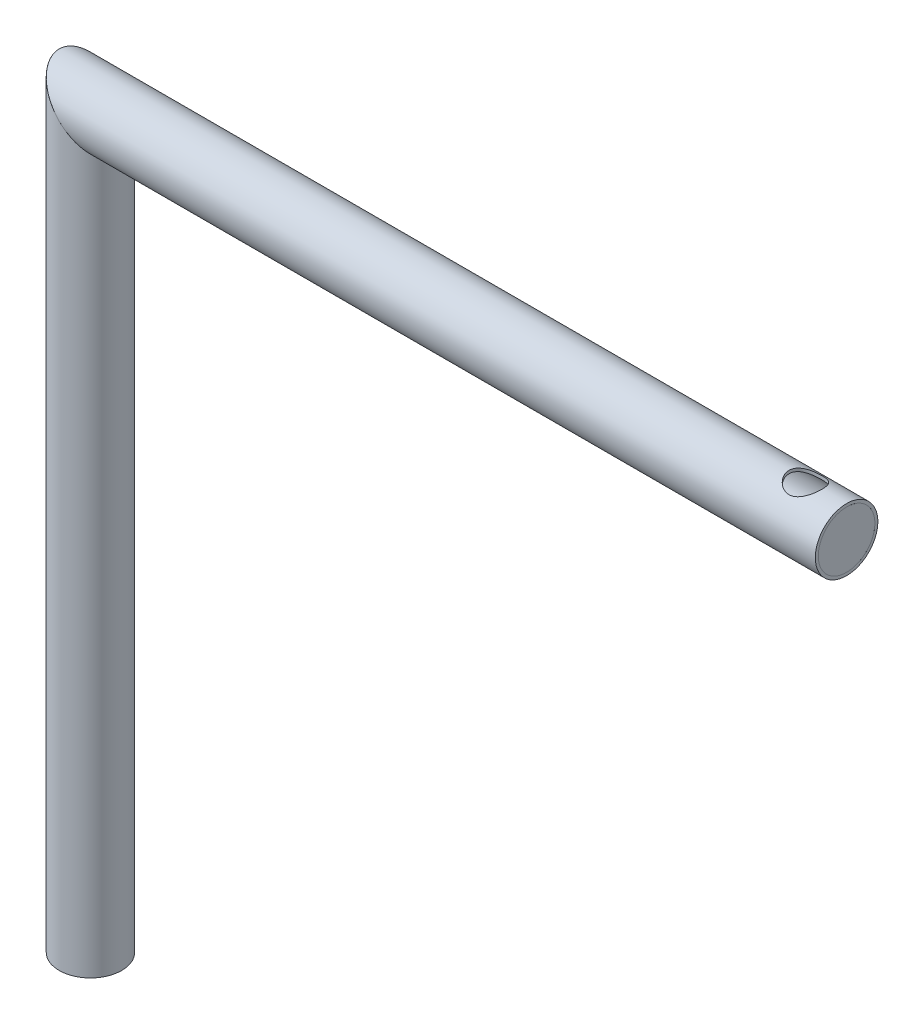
ISO-10303-21;
HEADER;
FILE_DESCRIPTION(('STEP AP214'),'2;1');
FILE_NAME('part.step','',(''),(''),'','','');
FILE_SCHEMA(('AUTOMOTIVE_DESIGN { 1 0 10303 214 1 1 1 1 }'));
ENDSEC;
DATA;
#1=APPLICATION_CONTEXT('core data for automotive mechanical design processes');
#2=APPLICATION_PROTOCOL_DEFINITION('international standard','automotive_design',2000,#1);
#3=PRODUCT_CONTEXT('',#1,'mechanical');
#4=PRODUCT('Part','Part','',(#3));
#5=PRODUCT_RELATED_PRODUCT_CATEGORY('part','',(#4));
#6=PRODUCT_DEFINITION_FORMATION('','',#4);
#7=PRODUCT_DEFINITION_CONTEXT('part definition',#1,'design');
#8=PRODUCT_DEFINITION('design','',#6,#7);
#9=PRODUCT_DEFINITION_SHAPE('','',#8);
#10=(LENGTH_UNIT() NAMED_UNIT(*) SI_UNIT(.MILLI.,.METRE.));
#11=(NAMED_UNIT(*) PLANE_ANGLE_UNIT() SI_UNIT($,.RADIAN.));
#12=(NAMED_UNIT(*) SI_UNIT($,.STERADIAN.) SOLID_ANGLE_UNIT());
#13=UNCERTAINTY_MEASURE_WITH_UNIT(LENGTH_MEASURE(1.E-05),#10,'distance_accuracy_value','');
#14=(GEOMETRIC_REPRESENTATION_CONTEXT(3) GLOBAL_UNCERTAINTY_ASSIGNED_CONTEXT((#13)) GLOBAL_UNIT_ASSIGNED_CONTEXT((#10,
#11,#12)) REPRESENTATION_CONTEXT('',''));
#15=CARTESIAN_POINT('',(0.,0.,0.));
#16=DIRECTION('',(0.,0.,1.));
#17=DIRECTION('',(1.,0.,0.));
#18=AXIS2_PLACEMENT_3D('',#15,#16,#17);
#19=CARTESIAN_POINT('',(0.,894.95,0.));
#20=DIRECTION('',(0.,-1.,0.));
#21=DIRECTION('',(0.,0.,-1.));
#22=AXIS2_PLACEMENT_3D('',#19,#20,#21);
#23=CYLINDRICAL_SURFACE('',#22,34.45);
#24=CARTESIAN_POINT('',(0.,0.,0.));
#25=DIRECTION('',(0.,-1.,0.));
#26=DIRECTION('',(0.,0.,-1.));
#27=AXIS2_PLACEMENT_3D('',#24,#25,#26);
#28=CIRCLE('',#27,34.45);
#29=CARTESIAN_POINT('',(0.,0.,-34.45));
#30=VERTEX_POINT('',#29);
#31=EDGE_CURVE('P0_E43',#30,#30,#28,.T.);
#32=ORIENTED_EDGE('',*,*,#31,.T.);
#33=EDGE_LOOP('',(#32));
#34=FACE_BOUND('',#33,.T.);
#35=CARTESIAN_POINT('',(0.,894.95,0.));
#36=DIRECTION('',(0.707106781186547,0.707106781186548,0.));
#37=DIRECTION('',(0.707106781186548,-0.707106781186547,0.));
#38=AXIS2_PLACEMENT_3D('',#35,#36,#37);
#39=ELLIPSE('',#38,48.7196572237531,34.45);
#40=CARTESIAN_POINT('',(34.45,860.5,0.));
#41=VERTEX_POINT('',#40);
#42=EDGE_CURVE('P0_E34',#41,#41,#39,.F.);
#43=ORIENTED_EDGE('',*,*,#42,.F.);
#44=EDGE_LOOP('',(#43));
#45=FACE_BOUND('',#44,.T.);
#46=ADVANCED_FACE('P0_F31',(#34,#45),#23,.F.);
#47=CARTESIAN_POINT('',(0.,894.95,0.));
#48=DIRECTION('',(0.707106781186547,0.707106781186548,0.));
#49=DIRECTION('',(-0.707106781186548,0.707106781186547,0.));
#50=AXIS2_PLACEMENT_3D('',#47,#48,#49);
#51=PLANE('',#50);
#52=CARTESIAN_POINT('',(0.,894.95,0.));
#53=DIRECTION('',(0.707106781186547,0.707106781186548,0.));
#54=DIRECTION('',(0.707106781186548,-0.707106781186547,0.));
#55=AXIS2_PLACEMENT_3D('',#52,#53,#54);
#56=ELLIPSE('',#55,53.8108260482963,38.05);
#57=CARTESIAN_POINT('',(38.05,856.9,0.));
#58=VERTEX_POINT('',#57);
#59=EDGE_CURVE('P0_E38',#58,#58,#56,.F.);
#60=ORIENTED_EDGE('',*,*,#59,.F.);
#61=EDGE_LOOP('',(#60));
#62=FACE_BOUND('',#61,.T.);
#63=ORIENTED_EDGE('',*,*,#42,.T.);
#64=EDGE_LOOP('',(#63));
#65=FACE_BOUND('',#64,.T.);
#66=ADVANCED_FACE('P0_F51',(#62,#65),#51,.T.);
#67=CARTESIAN_POINT('',(0.,0.,0.));
#68=DIRECTION('',(0.,1.,0.));
#69=DIRECTION('',(0.,0.,1.));
#70=AXIS2_PLACEMENT_3D('',#67,#68,#69);
#71=PLANE('',#70);
#72=CARTESIAN_POINT('',(0.,0.,0.));
#73=DIRECTION('',(0.,-1.,0.));
#74=DIRECTION('',(0.,0.,-1.));
#75=AXIS2_PLACEMENT_3D('',#72,#73,#74);
#76=CIRCLE('',#75,38.05);
#77=CARTESIAN_POINT('',(0.,0.,-38.05));
#78=VERTEX_POINT('',#77);
#79=EDGE_CURVE('P0_E10',#78,#78,#76,.F.);
#80=ORIENTED_EDGE('',*,*,#79,.F.);
#81=EDGE_LOOP('',(#80));
#82=FACE_BOUND('',#81,.T.);
#83=ORIENTED_EDGE('',*,*,#31,.F.);
#84=EDGE_LOOP('',(#83));
#85=FACE_BOUND('',#84,.T.);
#86=ADVANCED_FACE('P0_F57',(#82,#85),#71,.F.);
#87=CARTESIAN_POINT('',(0.,894.95,0.));
#88=DIRECTION('',(0.,-1.,0.));
#89=DIRECTION('',(0.,0.,-1.));
#90=AXIS2_PLACEMENT_3D('',#87,#88,#89);
#91=CYLINDRICAL_SURFACE('',#90,38.05);
#92=ORIENTED_EDGE('',*,*,#59,.T.);
#93=EDGE_LOOP('',(#92));
#94=FACE_BOUND('',#93,.T.);
#95=ORIENTED_EDGE('',*,*,#79,.T.);
#96=EDGE_LOOP('',(#95));
#97=FACE_BOUND('',#96,.T.);
#98=ADVANCED_FACE('P0_F59',(#94,#97),#91,.T.);
#99=CLOSED_SHELL('',(#46,#66,#86,#98));
#100=MANIFOLD_SOLID_BREP('P0_B2',#99);
#101=CARTESIAN_POINT('',(915.95,894.95,0.));
#102=DIRECTION('',(1.,0.,0.));
#103=DIRECTION('',(0.,1.,0.));
#104=AXIS2_PLACEMENT_3D('',#101,#102,#103);
#105=PLANE('',#104);
#106=CARTESIAN_POINT('',(915.95,894.95,0.));
#107=DIRECTION('',(1.,0.,0.));
#108=DIRECTION('',(0.,1.,0.));
#109=AXIS2_PLACEMENT_3D('',#106,#107,#108);
#110=CIRCLE('',#109,34.45);
#111=CARTESIAN_POINT('',(915.95,929.4,0.));
#112=VERTEX_POINT('',#111);
#113=EDGE_CURVE('P1_E18',#112,#112,#110,.T.);
#114=ORIENTED_EDGE('',*,*,#113,.F.);
#115=EDGE_LOOP('',(#114));
#116=FACE_BOUND('',#115,.T.);
#117=ADVANCED_FACE('P1_F15',(#116),#105,.F.);
#118=CARTESIAN_POINT('',(915.95,894.95,0.));
#119=DIRECTION('',(1.,0.,0.));
#120=DIRECTION('',(0.,1.,0.));
#121=AXIS2_PLACEMENT_3D('',#118,#119,#120);
#122=CYLINDRICAL_SURFACE('',#121,34.45);
#123=ORIENTED_EDGE('',*,*,#113,.T.);
#124=EDGE_LOOP('',(#123));
#125=FACE_BOUND('',#124,.T.);
#126=CARTESIAN_POINT('',(919.95,894.95,0.));
#127=DIRECTION('',(1.,0.,0.));
#128=DIRECTION('',(0.,1.,0.));
#129=AXIS2_PLACEMENT_3D('',#126,#127,#128);
#130=CIRCLE('',#129,34.45);
#131=CARTESIAN_POINT('',(919.95,929.4,0.));
#132=VERTEX_POINT('',#131);
#133=EDGE_CURVE('P1_E10',#132,#132,#130,.T.);
#134=ORIENTED_EDGE('',*,*,#133,.F.);
#135=EDGE_LOOP('',(#134));
#136=FACE_BOUND('',#135,.T.);
#137=ADVANCED_FACE('P1_F27',(#125,#136),#122,.T.);
#138=CARTESIAN_POINT('',(919.95,894.95,0.));
#139=DIRECTION('',(1.,0.,0.));
#140=DIRECTION('',(0.,1.,0.));
#141=AXIS2_PLACEMENT_3D('',#138,#139,#140);
#142=PLANE('',#141);
#143=ORIENTED_EDGE('',*,*,#133,.T.);
#144=EDGE_LOOP('',(#143));
#145=FACE_BOUND('',#144,.T.);
#146=ADVANCED_FACE('P1_F35',(#145),#142,.T.);
#147=CLOSED_SHELL('',(#117,#137,#146));
#148=MANIFOLD_SOLID_BREP('P1_B1',#147);
#149=CARTESIAN_POINT('',(919.95,894.95,0.));
#150=DIRECTION('',(-1.,0.,0.));
#151=DIRECTION('',(0.,0.,1.));
#152=AXIS2_PLACEMENT_3D('',#149,#150,#151);
#153=CYLINDRICAL_SURFACE('',#152,34.45);
#154=CARTESIAN_POINT('',(0.,894.95,0.));
#155=DIRECTION('',(-0.707106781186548,-0.707106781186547,0.));
#156=DIRECTION('',(-0.707106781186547,0.707106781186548,0.));
#157=AXIS2_PLACEMENT_3D('',#154,#155,#156);
#158=ELLIPSE('',#157,48.7196572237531,34.45);
#159=CARTESIAN_POINT('',(-34.45,929.4,0.));
#160=VERTEX_POINT('',#159);
#161=EDGE_CURVE('P2_E69',#160,#160,#158,.F.);
#162=ORIENTED_EDGE('',*,*,#161,.F.);
#163=EDGE_LOOP('',(#162));
#164=FACE_BOUND('',#163,.T.);
#165=CARTESIAN_POINT('',(919.95,894.95,0.));
#166=DIRECTION('',(-1.,0.,0.));
#167=DIRECTION('',(0.,0.,1.));
#168=AXIS2_PLACEMENT_3D('',#165,#166,#167);
#169=CIRCLE('',#168,34.45);
#170=CARTESIAN_POINT('',(919.95,894.95,34.45));
#171=VERTEX_POINT('',#170);
#172=EDGE_CURVE('P2_E67',#171,#171,#169,.T.);
#173=ORIENTED_EDGE('',*,*,#172,.F.);
#174=EDGE_LOOP('',(#173));
#175=FACE_BOUND('',#174,.T.);
#176=CARTESIAN_POINT('',(869.95,866.9,20.));
#177=CARTESIAN_POINT('',(869.443007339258,866.899996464,19.9999975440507));
#178=CARTESIAN_POINT('',(868.935978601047,866.886201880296,19.9806910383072));
#179=CARTESIAN_POINT('',(867.926288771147,866.83161393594,19.9037944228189));
#180=CARTESIAN_POINT('',(867.423628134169,866.790817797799,19.8462003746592));
#181=CARTESIAN_POINT('',(866.426268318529,866.683888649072,19.6936054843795));
#182=CARTESIAN_POINT('',(865.931577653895,866.617730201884,19.5985670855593));
#183=CARTESIAN_POINT('',(864.954184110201,866.462673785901,19.3724928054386));
#184=CARTESIAN_POINT('',(864.471481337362,866.373775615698,19.2414566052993));
#185=CARTESIAN_POINT('',(863.524286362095,866.177111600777,18.9460971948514));
#186=CARTESIAN_POINT('',(863.05968917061,866.06948424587,18.7820170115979));
#187=CARTESIAN_POINT('',(862.14708035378,865.838266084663,18.4215981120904));
#188=CARTESIAN_POINT('',(861.699076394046,865.714668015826,18.2252447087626));
#189=CARTESIAN_POINT('',(860.821513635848,865.45498300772,17.8019132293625));
#190=CARTESIAN_POINT('',(860.391957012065,865.318894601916,17.5749315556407));
#191=CARTESIAN_POINT('',(859.552839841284,865.037674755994,17.0919094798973));
#192=CARTESIAN_POINT('',(859.143273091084,864.892546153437,16.8358781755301));
#193=CARTESIAN_POINT('',(858.299658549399,864.579578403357,16.2652259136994));
#194=CARTESIAN_POINT('',(857.868136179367,864.411035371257,15.9472531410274));
#195=CARTESIAN_POINT('',(857.032663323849,864.070970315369,15.2783769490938));
#196=CARTESIAN_POINT('',(856.628714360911,863.899448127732,14.9274717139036));
#197=CARTESIAN_POINT('',(855.849717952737,863.557358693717,14.1939572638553));
#198=CARTESIAN_POINT('',(855.474689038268,863.386792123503,13.8113280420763));
#199=CARTESIAN_POINT('',(854.755547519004,863.05058216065,13.0159926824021));
#200=CARTESIAN_POINT('',(854.411436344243,862.884938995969,12.6032851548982));
#201=CARTESIAN_POINT('',(853.723576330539,862.546280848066,11.7069681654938));
#202=CARTESIAN_POINT('',(853.383244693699,862.374162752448,11.2203857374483));
#203=CARTESIAN_POINT('',(852.745173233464,862.045078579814,10.2151045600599));
#204=CARTESIAN_POINT('',(852.447436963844,861.888113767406,9.69640313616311));
#205=CARTESIAN_POINT('',(851.897905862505,861.593939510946,8.63025377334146));
#206=CARTESIAN_POINT('',(851.646081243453,861.456717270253,8.08282477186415));
#207=CARTESIAN_POINT('',(851.191396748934,861.206086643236,6.96275472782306));
#208=CARTESIAN_POINT('',(850.988529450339,861.092674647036,6.39011752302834));
#209=CARTESIAN_POINT('',(850.650829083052,860.902343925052,5.2772023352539));
#210=CARTESIAN_POINT('',(850.511496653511,860.823049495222,4.73869454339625));
#211=CARTESIAN_POINT('',(850.277795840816,860.6893972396,3.64894865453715));
#212=CARTESIAN_POINT('',(850.183424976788,860.635038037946,3.09771126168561));
#213=CARTESIAN_POINT('',(850.041160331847,860.552892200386,1.98770604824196));
#214=CARTESIAN_POINT('',(849.993233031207,860.525086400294,1.42894395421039));
#215=CARTESIAN_POINT('',(849.944527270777,860.496828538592,0.308697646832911));
#216=CARTESIAN_POINT('',(849.943744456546,860.496373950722,-0.252786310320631));
#217=CARTESIAN_POINT('',(849.986659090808,860.521272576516,-1.30785225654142));
#218=CARTESIAN_POINT('',(850.025186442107,860.543626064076,-1.80172596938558));
#219=CARTESIAN_POINT('',(850.138527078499,860.609137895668,-2.78385325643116));
#220=CARTESIAN_POINT('',(850.213336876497,860.652294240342,-3.27210736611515));
#221=CARTESIAN_POINT('',(850.398328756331,860.758413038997,-4.23966890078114));
#222=CARTESIAN_POINT('',(850.508512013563,860.82137615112,-4.71897602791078));
#223=CARTESIAN_POINT('',(850.762994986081,860.965699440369,-5.66560525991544));
#224=CARTESIAN_POINT('',(850.907296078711,861.047060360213,-6.13292688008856));
#225=CARTESIAN_POINT('',(851.229780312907,861.227142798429,-7.05652403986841));
#226=CARTESIAN_POINT('',(851.408221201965,861.325995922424,-7.512683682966));
#227=CARTESIAN_POINT('',(851.796563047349,861.538574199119,-8.40777928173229));
#228=CARTESIAN_POINT('',(852.006463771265,861.652299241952,-8.84671536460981));
#229=CARTESIAN_POINT('',(852.456055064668,861.892406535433,-9.70550630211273));
#230=CARTESIAN_POINT('',(852.695750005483,862.018790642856,-10.1253583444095));
#231=CARTESIAN_POINT('',(853.203259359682,862.281839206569,-10.9443506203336));
#232=CARTESIAN_POINT('',(853.471076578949,862.418504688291,-11.3434887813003));
#233=CARTESIAN_POINT('',(854.06564439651,862.71583282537,-12.1644080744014));
#234=CARTESIAN_POINT('',(854.395630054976,862.877446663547,-12.5835044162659));
#235=CARTESIAN_POINT('',(855.086648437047,863.206820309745,-13.392681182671));
#236=CARTESIAN_POINT('',(855.447683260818,863.374580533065,-13.7827596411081));
#237=CARTESIAN_POINT('',(856.199491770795,863.712744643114,-14.5329229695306));
#238=CARTESIAN_POINT('',(856.590301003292,863.8831514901,-14.8929708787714));
#239=CARTESIAN_POINT('',(857.399688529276,864.222523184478,-15.5811387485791));
#240=CARTESIAN_POINT('',(857.818267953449,864.391487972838,-15.9092574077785));
#241=CARTESIAN_POINT('',(858.727071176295,864.741346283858,-16.5647773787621));
#242=CARTESIAN_POINT('',(859.220203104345,864.921629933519,-16.8884871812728));
#243=CARTESIAN_POINT('',(860.236572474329,865.26961505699,-17.4928242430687));
#244=CARTESIAN_POINT('',(860.75981460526,865.437314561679,-17.7734447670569));
#245=CARTESIAN_POINT('',(861.833015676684,865.753673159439,-18.28847250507));
#246=CARTESIAN_POINT('',(862.382929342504,865.90236306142,-18.5229548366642));
#247=CARTESIAN_POINT('',(863.50695886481,866.174689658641,-18.9432535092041));
#248=CARTESIAN_POINT('',(864.081064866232,866.298336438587,-19.1290894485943));
#249=CARTESIAN_POINT('',(865.09078122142,866.485297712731,-19.4057459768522));
#250=CARTESIAN_POINT('',(865.521767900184,866.555881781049,-19.5086679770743));
#251=CARTESIAN_POINT('',(866.392136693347,866.678540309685,-19.6860036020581));
#252=CARTESIAN_POINT('',(866.831517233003,866.730618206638,-19.7604225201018));
#253=CARTESIAN_POINT('',(867.715875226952,866.814609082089,-19.8798296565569));
#254=CARTESIAN_POINT('',(868.160848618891,866.846535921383,-19.9248381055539));
#255=CARTESIAN_POINT('',(869.053871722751,866.889234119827,-19.9849260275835));
#256=CARTESIAN_POINT('',(869.501921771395,866.900003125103,-20.0000021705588));
#257=CARTESIAN_POINT('',(870.456992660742,866.899996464,-19.9999975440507));
#258=CARTESIAN_POINT('',(870.964021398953,866.886201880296,-19.9806910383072));
#259=CARTESIAN_POINT('',(871.973711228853,866.83161393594,-19.9037944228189));
#260=CARTESIAN_POINT('',(872.476371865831,866.790817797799,-19.8462003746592));
#261=CARTESIAN_POINT('',(873.473731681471,866.683888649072,-19.6936054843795));
#262=CARTESIAN_POINT('',(873.968422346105,866.617730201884,-19.5985670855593));
#263=CARTESIAN_POINT('',(874.945815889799,866.462673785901,-19.3724928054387));
#264=CARTESIAN_POINT('',(875.428518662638,866.373775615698,-19.2414566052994));
#265=CARTESIAN_POINT('',(876.375713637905,866.177111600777,-18.9460971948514));
#266=CARTESIAN_POINT('',(876.84031082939,866.06948424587,-18.7820170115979));
#267=CARTESIAN_POINT('',(877.75291964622,865.838266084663,-18.4215981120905));
#268=CARTESIAN_POINT('',(878.200923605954,865.714668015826,-18.2252447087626));
#269=CARTESIAN_POINT('',(879.078486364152,865.45498300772,-17.8019132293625));
#270=CARTESIAN_POINT('',(879.508042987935,865.318894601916,-17.5749315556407));
#271=CARTESIAN_POINT('',(880.347160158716,865.037674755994,-17.0919094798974));
#272=CARTESIAN_POINT('',(880.756726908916,864.892546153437,-16.8358781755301));
#273=CARTESIAN_POINT('',(881.600341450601,864.579578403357,-16.2652259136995));
#274=CARTESIAN_POINT('',(882.031863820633,864.411035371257,-15.9472531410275));
#275=CARTESIAN_POINT('',(882.867336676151,864.070970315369,-15.2783769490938));
#276=CARTESIAN_POINT('',(883.271285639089,863.899448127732,-14.9274717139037));
#277=CARTESIAN_POINT('',(884.050282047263,863.557358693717,-14.1939572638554));
#278=CARTESIAN_POINT('',(884.425310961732,863.386792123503,-13.8113280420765));
#279=CARTESIAN_POINT('',(885.144452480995,863.05058216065,-13.0159926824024));
#280=CARTESIAN_POINT('',(885.488563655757,862.884938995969,-12.6032851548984));
#281=CARTESIAN_POINT('',(886.176423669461,862.546280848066,-11.706968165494));
#282=CARTESIAN_POINT('',(886.516755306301,862.374162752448,-11.2203857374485));
#283=CARTESIAN_POINT('',(887.154826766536,862.045078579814,-10.2151045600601));
#284=CARTESIAN_POINT('',(887.452563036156,861.888113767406,-9.69640313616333));
#285=CARTESIAN_POINT('',(888.002094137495,861.593939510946,-8.63025377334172));
#286=CARTESIAN_POINT('',(888.253918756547,861.456717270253,-8.08282477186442));
#287=CARTESIAN_POINT('',(888.708603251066,861.206086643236,-6.96275472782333));
#288=CARTESIAN_POINT('',(888.911470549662,861.092674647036,-6.3901175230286));
#289=CARTESIAN_POINT('',(889.249170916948,860.902343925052,-5.27720233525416));
#290=CARTESIAN_POINT('',(889.388503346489,860.823049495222,-4.73869454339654));
#291=CARTESIAN_POINT('',(889.622204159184,860.6893972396,-3.64894865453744));
#292=CARTESIAN_POINT('',(889.716575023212,860.635038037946,-3.09771126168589));
#293=CARTESIAN_POINT('',(889.858839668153,860.552892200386,-1.98770604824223));
#294=CARTESIAN_POINT('',(889.906766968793,860.525086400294,-1.42894395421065));
#295=CARTESIAN_POINT('',(889.955472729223,860.496828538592,-0.308697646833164));
#296=CARTESIAN_POINT('',(889.956255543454,860.496373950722,0.252786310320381));
#297=CARTESIAN_POINT('',(889.913340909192,860.521272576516,1.30785225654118));
#298=CARTESIAN_POINT('',(889.874813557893,860.543626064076,1.80172596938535));
#299=CARTESIAN_POINT('',(889.761472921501,860.609137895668,2.78385325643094));
#300=CARTESIAN_POINT('',(889.686663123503,860.652294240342,3.27210736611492));
#301=CARTESIAN_POINT('',(889.50167124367,860.758413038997,4.23966890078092));
#302=CARTESIAN_POINT('',(889.391487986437,860.82137615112,4.71897602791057));
#303=CARTESIAN_POINT('',(889.137005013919,860.965699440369,5.66560525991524));
#304=CARTESIAN_POINT('',(888.992703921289,861.047060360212,6.13292688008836));
#305=CARTESIAN_POINT('',(888.670219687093,861.227142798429,7.05652403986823));
#306=CARTESIAN_POINT('',(888.491778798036,861.325995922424,7.51268368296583));
#307=CARTESIAN_POINT('',(888.103436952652,861.538574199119,8.40777928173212));
#308=CARTESIAN_POINT('',(887.893536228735,861.652299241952,8.84671536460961));
#309=CARTESIAN_POINT('',(887.443944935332,861.892406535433,9.70550630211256));
#310=CARTESIAN_POINT('',(887.204249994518,862.018790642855,10.1253583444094));
#311=CARTESIAN_POINT('',(886.696740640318,862.281839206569,10.9443506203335));
#312=CARTESIAN_POINT('',(886.428923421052,862.418504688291,11.3434887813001));
#313=CARTESIAN_POINT('',(885.834355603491,862.71583282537,12.1644080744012));
#314=CARTESIAN_POINT('',(885.504369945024,862.877446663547,12.5835044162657));
#315=CARTESIAN_POINT('',(884.813351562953,863.206820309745,13.3926811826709));
#316=CARTESIAN_POINT('',(884.452316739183,863.374580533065,13.7827596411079));
#317=CARTESIAN_POINT('',(883.700508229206,863.712744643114,14.5329229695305));
#318=CARTESIAN_POINT('',(883.309698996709,863.8831514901,14.8929708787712));
#319=CARTESIAN_POINT('',(882.500311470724,864.222523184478,15.5811387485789));
#320=CARTESIAN_POINT('',(882.081732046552,864.391487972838,15.9092574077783));
#321=CARTESIAN_POINT('',(881.172928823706,864.741346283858,16.5647773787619));
#322=CARTESIAN_POINT('',(880.679796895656,864.921629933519,16.8884871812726));
#323=CARTESIAN_POINT('',(879.663427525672,865.26961505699,17.4928242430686));
#324=CARTESIAN_POINT('',(879.14018539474,865.437314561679,17.7734447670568));
#325=CARTESIAN_POINT('',(878.066984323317,865.753673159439,18.2884725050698));
#326=CARTESIAN_POINT('',(877.517070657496,865.90236306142,18.5229548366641));
#327=CARTESIAN_POINT('',(876.393041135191,866.174689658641,18.943253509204));
#328=CARTESIAN_POINT('',(875.818935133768,866.298336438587,19.1290894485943));
#329=CARTESIAN_POINT('',(874.80921877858,866.485297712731,19.4057459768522));
#330=CARTESIAN_POINT('',(874.378232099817,866.555881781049,19.5086679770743));
#331=CARTESIAN_POINT('',(873.507863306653,866.678540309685,19.6860036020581));
#332=CARTESIAN_POINT('',(873.068482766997,866.730618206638,19.7604225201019));
#333=CARTESIAN_POINT('',(872.184124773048,866.814609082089,19.879829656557));
#334=CARTESIAN_POINT('',(871.739151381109,866.846535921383,19.9248381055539));
#335=CARTESIAN_POINT('',(870.846128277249,866.889234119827,19.9849260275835));
#336=CARTESIAN_POINT('',(870.398078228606,866.900003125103,20.0000021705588));
#337=CARTESIAN_POINT('',(869.95,866.9,20.));
#338=B_SPLINE_CURVE_WITH_KNOTS('',3,(#176,#177,#178,#179,#180,#181,#182,#183,#184,#185,#186,
#187,#188,#189,#190,#191,#192,#193,#194,#195,#196,#197,#198,#199,#200,#201,#202,#203,#204,#205,
#206,#207,#208,#209,#210,#211,#212,#213,#214,#215,#216,#217,#218,#219,#220,#221,#222,#223,#224,
#225,#226,#227,#228,#229,#230,#231,#232,#233,#234,#235,#236,#237,#238,#239,#240,#241,#242,#243,
#244,#245,#246,#247,#248,#249,#250,#251,#252,#253,#254,#255,#256,#257,#258,#259,#260,#261,#262,
#263,#264,#265,#266,#267,#268,#269,#270,#271,#272,#273,#274,#275,#276,#277,#278,#279,#280,#281,
#282,#283,#284,#285,#286,#287,#288,#289,#290,#291,#292,#293,#294,#295,#296,#297,#298,#299,#300,
#301,#302,#303,#304,#305,#306,#307,#308,#309,#310,#311,#312,#313,#314,#315,#316,#317,#318,#319,
#320,#321,#322,#323,#324,#325,#326,#327,#328,#329,#330,#331,#332,#333,#334,#335,#336,#337),
.UNSPECIFIED.,.T.,.F.,(4,2,2,2,2,2,2,2,2,2,2,2,2,2,2,2,2,2,2,2,2,2,2,2,2,2,2,2,2,2,2,2,2,2,2,2,
2,2,2,2,2,2,2,2,2,2,2,2,2,2,2,2,2,2,2,2,2,2,2,2,2,2,2,2,2,2,2,2,2,2,2,2,2,2,2,2,2,2,2,2,4),(0.,
1.52049337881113,3.04114318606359,4.56332210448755,6.08551450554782,7.59689571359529,
9.10896664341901,10.6212153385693,12.1329917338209,13.8169686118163,15.5010384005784,
17.1861784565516,18.8713964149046,20.7236647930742,22.5760876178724,24.4273042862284,
26.278240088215,27.9614415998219,29.6445502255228,31.3264431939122,33.0081808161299,
34.4940426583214,35.9797617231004,37.4655301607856,38.9513585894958,40.4488820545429,
41.946394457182,43.4441268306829,44.9420087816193,46.6123663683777,48.2828370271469,
49.9553342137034,51.6278995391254,53.4760524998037,55.3244940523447,57.1699007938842,
59.0145629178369,60.3593955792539,61.7039783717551,63.0476352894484,64.3914416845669,
65.9119350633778,67.4325848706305,68.9547637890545,70.4769561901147,71.9883373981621,
73.500408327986,75.0126570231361,76.5244334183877,78.2084102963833,79.8924800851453,
81.5776201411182,83.2628380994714,85.1151064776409,86.9675293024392,88.8187459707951,
90.6696817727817,92.3528832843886,94.0359919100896,95.717884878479,97.3996225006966,
98.8854843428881,100.371203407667,101.856971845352,103.342800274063,104.84032373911,
106.337836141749,107.83556851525,109.333450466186,111.003808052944,112.674278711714,
114.34677589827,116.019341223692,117.86749418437,119.715935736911,121.561342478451,
123.406004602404,124.750837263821,126.095420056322,127.439076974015,128.782883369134),.UNSPECIFIED.);
#339=CARTESIAN_POINT('',(869.95,866.9,20.));
#340=VERTEX_POINT('',#339);
#341=EDGE_CURVE('P2_E19',#340,#340,#338,.T.);
#342=ORIENTED_EDGE('',*,*,#341,.T.);
#343=EDGE_LOOP('',(#342));
#344=FACE_BOUND('',#343,.T.);
#345=CARTESIAN_POINT('',(869.95,923.,20.));
#346=CARTESIAN_POINT('',(870.456992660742,923.000003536,19.9999975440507));
#347=CARTESIAN_POINT('',(870.964021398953,923.013798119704,19.9806910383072));
#348=CARTESIAN_POINT('',(871.973711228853,923.068386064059,19.9037944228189));
#349=CARTESIAN_POINT('',(872.476371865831,923.109182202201,19.8462003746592));
#350=CARTESIAN_POINT('',(873.473731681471,923.216111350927,19.6936054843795));
#351=CARTESIAN_POINT('',(873.968422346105,923.282269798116,19.5985670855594));
#352=CARTESIAN_POINT('',(874.945815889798,923.437326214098,19.3724928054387));
#353=CARTESIAN_POINT('',(875.428518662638,923.526224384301,19.2414566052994));
#354=CARTESIAN_POINT('',(876.375713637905,923.722888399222,18.9460971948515));
#355=CARTESIAN_POINT('',(876.84031082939,923.830515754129,18.782017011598));
#356=CARTESIAN_POINT('',(877.75291964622,924.061733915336,18.4215981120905));
#357=CARTESIAN_POINT('',(878.200923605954,924.185331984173,18.2252447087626));
#358=CARTESIAN_POINT('',(879.078486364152,924.445016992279,17.8019132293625));
#359=CARTESIAN_POINT('',(879.508042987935,924.581105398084,17.5749315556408));
#360=CARTESIAN_POINT('',(880.347160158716,924.862325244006,17.0919094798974));
#361=CARTESIAN_POINT('',(880.756726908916,925.007453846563,16.8358781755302));
#362=CARTESIAN_POINT('',(881.600341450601,925.320421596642,16.2652259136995));
#363=CARTESIAN_POINT('',(882.031863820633,925.488964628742,15.9472531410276));
#364=CARTESIAN_POINT('',(882.867336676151,925.82902968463,15.278376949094));
#365=CARTESIAN_POINT('',(883.271285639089,926.000551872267,14.9274717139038));
#366=CARTESIAN_POINT('',(884.050282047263,926.342641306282,14.1939572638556));
#367=CARTESIAN_POINT('',(884.425310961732,926.513207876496,13.8113280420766));
#368=CARTESIAN_POINT('',(885.144452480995,926.84941783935,13.0159926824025));
#369=CARTESIAN_POINT('',(885.488563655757,927.015061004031,12.6032851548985));
#370=CARTESIAN_POINT('',(886.176423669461,927.353719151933,11.706968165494));
#371=CARTESIAN_POINT('',(886.516755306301,927.525837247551,11.2203857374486));
#372=CARTESIAN_POINT('',(887.154826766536,927.854921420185,10.2151045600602));
#373=CARTESIAN_POINT('',(887.452563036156,928.011886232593,9.69640313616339));
#374=CARTESIAN_POINT('',(888.002094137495,928.306060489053,8.63025377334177));
#375=CARTESIAN_POINT('',(888.253918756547,928.443282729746,8.08282477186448));
#376=CARTESIAN_POINT('',(888.708603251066,928.693913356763,6.96275472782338));
#377=CARTESIAN_POINT('',(888.911470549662,928.807325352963,6.39011752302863));
#378=CARTESIAN_POINT('',(889.249170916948,928.997656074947,5.27720233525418));
#379=CARTESIAN_POINT('',(889.388503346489,929.076950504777,4.73869454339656));
#380=CARTESIAN_POINT('',(889.622204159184,929.210602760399,3.64894865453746));
#381=CARTESIAN_POINT('',(889.716575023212,929.264961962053,3.09771126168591));
#382=CARTESIAN_POINT('',(889.858839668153,929.347107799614,1.98770604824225));
#383=CARTESIAN_POINT('',(889.906766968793,929.374913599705,1.42894395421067));
#384=CARTESIAN_POINT('',(889.955472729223,929.403171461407,0.308697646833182));
#385=CARTESIAN_POINT('',(889.956255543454,929.403626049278,-0.252786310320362));
#386=CARTESIAN_POINT('',(889.913340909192,929.378727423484,-1.30785225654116));
#387=CARTESIAN_POINT('',(889.874813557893,929.356373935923,-1.80172596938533));
#388=CARTESIAN_POINT('',(889.761472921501,929.290862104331,-2.78385325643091));
#389=CARTESIAN_POINT('',(889.686663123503,929.247705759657,-3.27210736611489));
#390=CARTESIAN_POINT('',(889.50167124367,929.141586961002,-4.23966890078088));
#391=CARTESIAN_POINT('',(889.391487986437,929.078623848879,-4.71897602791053));
#392=CARTESIAN_POINT('',(889.137005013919,928.934300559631,-5.6656052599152));
#393=CARTESIAN_POINT('',(888.992703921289,928.852939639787,-6.13292688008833));
#394=CARTESIAN_POINT('',(888.670219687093,928.67285720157,-7.05652403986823));
#395=CARTESIAN_POINT('',(888.491778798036,928.574004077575,-7.51268368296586));
#396=CARTESIAN_POINT('',(888.103436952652,928.361425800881,-8.40777928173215));
#397=CARTESIAN_POINT('',(887.893536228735,928.247700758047,-8.84671536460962));
#398=CARTESIAN_POINT('',(887.443944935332,928.007593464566,-9.70550630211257));
#399=CARTESIAN_POINT('',(887.204249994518,927.881209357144,-10.1253583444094));
#400=CARTESIAN_POINT('',(886.696740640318,927.61816079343,-10.9443506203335));
#401=CARTESIAN_POINT('',(886.428923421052,927.481495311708,-11.3434887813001));
#402=CARTESIAN_POINT('',(885.834355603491,927.184167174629,-12.1644080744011));
#403=CARTESIAN_POINT('',(885.504369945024,927.022553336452,-12.5835044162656));
#404=CARTESIAN_POINT('',(884.813351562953,926.693179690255,-13.3926811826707));
#405=CARTESIAN_POINT('',(884.452316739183,926.525419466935,-13.7827596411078));
#406=CARTESIAN_POINT('',(883.700508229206,926.187255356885,-14.5329229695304));
#407=CARTESIAN_POINT('',(883.309698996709,926.016848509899,-14.8929708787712));
#408=CARTESIAN_POINT('',(882.500311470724,925.677476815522,-15.5811387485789));
#409=CARTESIAN_POINT('',(882.081732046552,925.508512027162,-15.9092574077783));
#410=CARTESIAN_POINT('',(881.172928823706,925.158653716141,-16.5647773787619));
#411=CARTESIAN_POINT('',(880.679796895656,924.978370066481,-16.8884871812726));
#412=CARTESIAN_POINT('',(879.663427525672,924.630384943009,-17.4928242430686));
#413=CARTESIAN_POINT('',(879.14018539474,924.462685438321,-17.7734447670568));
#414=CARTESIAN_POINT('',(878.066984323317,924.146326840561,-18.2884725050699));
#415=CARTESIAN_POINT('',(877.517070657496,923.99763693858,-18.5229548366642));
#416=CARTESIAN_POINT('',(876.39304113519,923.725310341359,-18.9432535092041));
#417=CARTESIAN_POINT('',(875.818935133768,923.601663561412,-19.1290894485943));
#418=CARTESIAN_POINT('',(874.80921877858,923.414702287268,-19.4057459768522));
#419=CARTESIAN_POINT('',(874.378232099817,923.34411821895,-19.5086679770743));
#420=CARTESIAN_POINT('',(873.507863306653,923.221459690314,-19.686003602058));
#421=CARTESIAN_POINT('',(873.068482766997,923.169381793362,-19.7604225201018));
#422=CARTESIAN_POINT('',(872.184124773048,923.085390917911,-19.8798296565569));
#423=CARTESIAN_POINT('',(871.739151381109,923.053464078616,-19.9248381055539));
#424=CARTESIAN_POINT('',(870.846128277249,923.010765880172,-19.9849260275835));
#425=CARTESIAN_POINT('',(870.398078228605,922.999996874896,-20.0000021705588));
#426=CARTESIAN_POINT('',(869.443007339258,923.000003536,-19.9999975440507));
#427=CARTESIAN_POINT('',(868.935978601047,923.013798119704,-19.9806910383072));
#428=CARTESIAN_POINT('',(867.926288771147,923.068386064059,-19.9037944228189));
#429=CARTESIAN_POINT('',(867.423628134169,923.109182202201,-19.8462003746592));
#430=CARTESIAN_POINT('',(866.426268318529,923.216111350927,-19.6936054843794));
#431=CARTESIAN_POINT('',(865.931577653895,923.282269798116,-19.5985670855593));
#432=CARTESIAN_POINT('',(864.954184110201,923.437326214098,-19.3724928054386));
#433=CARTESIAN_POINT('',(864.471481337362,923.526224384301,-19.2414566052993));
#434=CARTESIAN_POINT('',(863.524286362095,923.722888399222,-18.9460971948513));
#435=CARTESIAN_POINT('',(863.05968917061,923.83051575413,-18.7820170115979));
#436=CARTESIAN_POINT('',(862.14708035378,924.061733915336,-18.4215981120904));
#437=CARTESIAN_POINT('',(861.699076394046,924.185331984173,-18.2252447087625));
#438=CARTESIAN_POINT('',(860.821513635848,924.44501699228,-17.8019132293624));
#439=CARTESIAN_POINT('',(860.391957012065,924.581105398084,-17.5749315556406));
#440=CARTESIAN_POINT('',(859.552839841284,924.862325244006,-17.0919094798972));
#441=CARTESIAN_POINT('',(859.143273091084,925.007453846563,-16.83587817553));
#442=CARTESIAN_POINT('',(858.299658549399,925.320421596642,-16.2652259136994));
#443=CARTESIAN_POINT('',(857.868136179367,925.488964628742,-15.9472531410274));
#444=CARTESIAN_POINT('',(857.032663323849,925.829029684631,-15.2783769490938));
#445=CARTESIAN_POINT('',(856.628714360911,926.000551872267,-14.9274717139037));
#446=CARTESIAN_POINT('',(855.849717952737,926.342641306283,-14.1939572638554));
#447=CARTESIAN_POINT('',(855.474689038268,926.513207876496,-13.8113280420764));
#448=CARTESIAN_POINT('',(854.755547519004,926.84941783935,-13.0159926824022));
#449=CARTESIAN_POINT('',(854.411436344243,927.015061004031,-12.6032851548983));
#450=CARTESIAN_POINT('',(853.723576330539,927.353719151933,-11.7069681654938));
#451=CARTESIAN_POINT('',(853.383244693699,927.525837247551,-11.2203857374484));
#452=CARTESIAN_POINT('',(852.745173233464,927.854921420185,-10.2151045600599));
#453=CARTESIAN_POINT('',(852.447436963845,928.011886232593,-9.69640313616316));
#454=CARTESIAN_POINT('',(851.897905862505,928.306060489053,-8.63025377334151));
#455=CARTESIAN_POINT('',(851.646081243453,928.443282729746,-8.08282477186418));
#456=CARTESIAN_POINT('',(851.191396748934,928.693913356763,-6.96275472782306));
#457=CARTESIAN_POINT('',(850.988529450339,928.807325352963,-6.39011752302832));
#458=CARTESIAN_POINT('',(850.650829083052,928.997656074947,-5.27720233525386));
#459=CARTESIAN_POINT('',(850.511496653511,929.076950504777,-4.73869454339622));
#460=CARTESIAN_POINT('',(850.277795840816,929.210602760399,-3.64894865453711));
#461=CARTESIAN_POINT('',(850.183424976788,929.264961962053,-3.09771126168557));
#462=CARTESIAN_POINT('',(850.041160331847,929.347107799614,-1.98770604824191));
#463=CARTESIAN_POINT('',(849.993233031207,929.374913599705,-1.42894395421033));
#464=CARTESIAN_POINT('',(849.944527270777,929.403171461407,-0.308697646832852));
#465=CARTESIAN_POINT('',(849.943744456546,929.403626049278,0.252786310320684));
#466=CARTESIAN_POINT('',(849.986659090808,929.378727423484,1.30785225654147));
#467=CARTESIAN_POINT('',(850.025186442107,929.356373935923,1.80172596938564));
#468=CARTESIAN_POINT('',(850.138527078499,929.290862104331,2.78385325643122));
#469=CARTESIAN_POINT('',(850.213336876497,929.247705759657,3.27210736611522));
#470=CARTESIAN_POINT('',(850.398328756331,929.141586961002,4.2396689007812));
#471=CARTESIAN_POINT('',(850.508512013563,929.07862384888,4.71897602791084));
#472=CARTESIAN_POINT('',(850.762994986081,928.934300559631,5.66560525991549));
#473=CARTESIAN_POINT('',(850.907296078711,928.852939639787,6.13292688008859));
#474=CARTESIAN_POINT('',(851.229780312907,928.67285720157,7.05652403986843));
#475=CARTESIAN_POINT('',(851.408221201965,928.574004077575,7.51268368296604));
#476=CARTESIAN_POINT('',(851.796563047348,928.36142580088,8.40777928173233));
#477=CARTESIAN_POINT('',(852.006463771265,928.247700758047,8.84671536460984));
#478=CARTESIAN_POINT('',(852.456055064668,928.007593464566,9.70550630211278));
#479=CARTESIAN_POINT('',(852.695750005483,927.881209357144,10.1253583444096));
#480=CARTESIAN_POINT('',(853.203259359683,927.61816079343,10.9443506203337));
#481=CARTESIAN_POINT('',(853.471076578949,927.481495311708,11.3434887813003));
#482=CARTESIAN_POINT('',(854.06564439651,927.184167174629,12.1644080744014));
#483=CARTESIAN_POINT('',(854.395630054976,927.022553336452,12.5835044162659));
#484=CARTESIAN_POINT('',(855.086648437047,926.693179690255,13.3926811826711));
#485=CARTESIAN_POINT('',(855.447683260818,926.525419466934,13.7827596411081));
#486=CARTESIAN_POINT('',(856.199491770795,926.187255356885,14.5329229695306));
#487=CARTESIAN_POINT('',(856.590301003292,926.016848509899,14.8929708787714));
#488=CARTESIAN_POINT('',(857.399688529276,925.677476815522,15.5811387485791));
#489=CARTESIAN_POINT('',(857.818267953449,925.508512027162,15.9092574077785));
#490=CARTESIAN_POINT('',(858.727071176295,925.158653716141,16.564777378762));
#491=CARTESIAN_POINT('',(859.220203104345,924.97837006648,16.8884871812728));
#492=CARTESIAN_POINT('',(860.236572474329,924.630384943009,17.4928242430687));
#493=CARTESIAN_POINT('',(860.75981460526,924.462685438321,17.7734447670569));
#494=CARTESIAN_POINT('',(861.833015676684,924.146326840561,18.28847250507));
#495=CARTESIAN_POINT('',(862.382929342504,923.99763693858,18.5229548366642));
#496=CARTESIAN_POINT('',(863.50695886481,923.725310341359,18.9432535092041));
#497=CARTESIAN_POINT('',(864.081064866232,923.601663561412,19.1290894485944));
#498=CARTESIAN_POINT('',(865.09078122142,923.414702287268,19.4057459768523));
#499=CARTESIAN_POINT('',(865.521767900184,923.34411821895,19.5086679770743));
#500=CARTESIAN_POINT('',(866.392136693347,923.221459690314,19.6860036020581));
#501=CARTESIAN_POINT('',(866.831517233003,923.169381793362,19.7604225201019));
#502=CARTESIAN_POINT('',(867.715875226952,923.085390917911,19.879829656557));
#503=CARTESIAN_POINT('',(868.160848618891,923.053464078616,19.9248381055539));
#504=CARTESIAN_POINT('',(869.053871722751,923.010765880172,19.9849260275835));
#505=CARTESIAN_POINT('',(869.501921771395,922.999996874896,20.0000021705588));
#506=CARTESIAN_POINT('',(869.95,923.,20.));
#507=B_SPLINE_CURVE_WITH_KNOTS('',3,(#345,#346,#347,#348,#349,#350,#351,#352,#353,#354,#355,
#356,#357,#358,#359,#360,#361,#362,#363,#364,#365,#366,#367,#368,#369,#370,#371,#372,#373,#374,
#375,#376,#377,#378,#379,#380,#381,#382,#383,#384,#385,#386,#387,#388,#389,#390,#391,#392,#393,
#394,#395,#396,#397,#398,#399,#400,#401,#402,#403,#404,#405,#406,#407,#408,#409,#410,#411,#412,
#413,#414,#415,#416,#417,#418,#419,#420,#421,#422,#423,#424,#425,#426,#427,#428,#429,#430,#431,
#432,#433,#434,#435,#436,#437,#438,#439,#440,#441,#442,#443,#444,#445,#446,#447,#448,#449,#450,
#451,#452,#453,#454,#455,#456,#457,#458,#459,#460,#461,#462,#463,#464,#465,#466,#467,#468,#469,
#470,#471,#472,#473,#474,#475,#476,#477,#478,#479,#480,#481,#482,#483,#484,#485,#486,#487,#488,
#489,#490,#491,#492,#493,#494,#495,#496,#497,#498,#499,#500,#501,#502,#503,#504,#505,#506),
.UNSPECIFIED.,.T.,.F.,(4,2,2,2,2,2,2,2,2,2,2,2,2,2,2,2,2,2,2,2,2,2,2,2,2,2,2,2,2,2,2,2,2,2,2,2,
2,2,2,2,2,2,2,2,2,2,2,2,2,2,2,2,2,2,2,2,2,2,2,2,2,2,2,2,2,2,2,2,2,2,2,2,2,2,2,2,2,2,2,2,4),(0.,
1.52049337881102,3.04114318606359,4.56332210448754,6.08551450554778,7.59689571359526,
9.10896664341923,10.6212153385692,12.1329917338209,13.8169686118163,15.5010384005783,
17.1861784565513,18.8713964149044,20.723664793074,22.5760876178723,24.4273042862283,
26.2782400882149,27.9614415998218,29.6445502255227,31.3264431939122,33.0081808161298,
34.4940426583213,35.9797617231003,37.4655301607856,38.9513585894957,40.4488820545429,
41.946394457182,43.444126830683,44.9420087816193,46.6123663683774,48.2828370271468,
49.9553342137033,51.6278995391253,53.4760524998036,55.3244940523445,57.1699007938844,
59.0145629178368,60.3593955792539,61.7039783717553,63.0476352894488,64.3914416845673,
65.9119350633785,67.4325848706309,68.954763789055,70.4769561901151,71.9883373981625,
73.5004083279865,75.0126570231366,76.5244334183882,78.2084102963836,79.8924800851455,
81.5776201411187,83.2628380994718,85.1151064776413,86.9675293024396,88.8187459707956,
90.6696817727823,92.3528832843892,94.0359919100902,95.7178848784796,97.3996225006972,
98.8854843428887,100.371203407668,101.856971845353,103.342800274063,104.84032373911,
106.337836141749,107.83556851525,109.333450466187,111.003808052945,112.674278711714,
114.346775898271,116.019341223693,117.867494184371,119.715935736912,121.561342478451,
123.406004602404,124.750837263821,126.095420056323,127.439076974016,128.782883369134),.UNSPECIFIED.);
#508=CARTESIAN_POINT('',(869.95,923.,20.));
#509=VERTEX_POINT('',#508);
#510=EDGE_CURVE('P2_E70',#509,#509,#507,.T.);
#511=ORIENTED_EDGE('',*,*,#510,.T.);
#512=EDGE_LOOP('',(#511));
#513=FACE_BOUND('',#512,.T.);
#514=ADVANCED_FACE('P2_F15',(#164,#175,#344,#513),#153,.F.);
#515=CARTESIAN_POINT('',(869.95,853.,0.));
#516=DIRECTION('',(0.,1.,0.));
#517=DIRECTION('',(0.,0.,1.));
#518=AXIS2_PLACEMENT_3D('',#515,#516,#517);
#519=CYLINDRICAL_SURFACE('',#518,20.);
#520=ORIENTED_EDGE('',*,*,#341,.F.);
#521=EDGE_LOOP('',(#520));
#522=FACE_BOUND('',#521,.T.);
#523=CARTESIAN_POINT('',(869.95,862.580222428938,-19.9999999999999));
#524=CARTESIAN_POINT('',(869.432770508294,862.580217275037,-19.9999959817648));
#525=CARTESIAN_POINT('',(868.915469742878,862.567780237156,-19.9799054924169));
#526=CARTESIAN_POINT('',(867.885095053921,862.518513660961,-19.8998324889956));
#527=CARTESIAN_POINT('',(867.372021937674,862.481679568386,-19.8398425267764));
#528=CARTESIAN_POINT('',(866.353659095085,862.385004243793,-19.6807569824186));
#529=CARTESIAN_POINT('',(865.84837781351,862.325139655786,-19.5816216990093));
#530=CARTESIAN_POINT('',(864.849735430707,862.18461091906,-19.3455574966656));
#531=CARTESIAN_POINT('',(864.356374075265,862.103947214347,-19.2086293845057));
#532=CARTESIAN_POINT('',(863.387292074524,861.92506944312,-18.8994216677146));
#533=CARTESIAN_POINT('',(862.911488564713,861.826955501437,-18.7273429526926));
#534=CARTESIAN_POINT('',(861.977103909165,861.615897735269,-18.3490328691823));
#535=CARTESIAN_POINT('',(861.518522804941,861.502953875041,-18.1428014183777));
#536=CARTESIAN_POINT('',(860.62059947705,861.265393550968,-17.6978350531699));
#537=CARTESIAN_POINT('',(860.181257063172,861.140777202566,-17.4591004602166));
#538=CARTESIAN_POINT('',(859.323345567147,860.882995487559,-16.950604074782));
#539=CARTESIAN_POINT('',(858.904784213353,860.749826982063,-16.6808308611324));
#540=CARTESIAN_POINT('',(858.052794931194,860.465651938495,-16.085728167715));
#541=CARTESIAN_POINT('',(857.621510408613,860.314128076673,-15.7575739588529));
#542=CARTESIAN_POINT('',(856.787469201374,860.008561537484,-15.0678681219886));
#543=CARTESIAN_POINT('',(856.384714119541,859.854518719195,-14.7063146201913));
#544=CARTESIAN_POINT('',(855.609302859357,859.547581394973,-13.9512517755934));
#545=CARTESIAN_POINT('',(855.236667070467,859.394687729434,-13.5577211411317));
#546=CARTESIAN_POINT('',(854.523843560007,859.093836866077,-12.7407803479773));
#547=CARTESIAN_POINT('',(854.183645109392,858.9458780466,-12.3173801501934));
#548=CARTESIAN_POINT('',(853.512767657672,858.647272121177,-11.4087806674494));
#549=CARTESIAN_POINT('',(853.184827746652,858.497291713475,-10.9213326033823));
#550=CARTESIAN_POINT('',(852.571527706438,858.211189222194,-9.91641048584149));
#551=CARTESIAN_POINT('',(852.286170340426,858.075068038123,-9.3989344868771));
#552=CARTESIAN_POINT('',(851.761065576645,857.820670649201,-8.33744924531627));
#553=CARTESIAN_POINT('',(851.521293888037,857.702384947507,-7.79345432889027));
#554=CARTESIAN_POINT('',(851.090042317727,857.487144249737,-6.68257939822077));
#555=CARTESIAN_POINT('',(850.89855666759,857.390186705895,-6.11570212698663));
#556=CARTESIAN_POINT('',(850.57930326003,857.227207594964,-5.00820415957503));
#557=CARTESIAN_POINT('',(850.447755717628,857.15937469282,-4.46893852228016));
#558=CARTESIAN_POINT('',(850.229681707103,857.046375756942,-3.37902841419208));
#559=CARTESIAN_POINT('',(850.143153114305,857.001208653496,-2.82838448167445));
#560=CARTESIAN_POINT('',(850.016362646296,856.934878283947,-1.72067174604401));
#561=CARTESIAN_POINT('',(849.976074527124,856.913701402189,-1.16360676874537));
#562=CARTESIAN_POINT('',(849.942269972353,856.895939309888,-0.0476832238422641));
#563=CARTESIAN_POINT('',(849.948750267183,856.899352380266,0.511175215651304));
#564=CARTESIAN_POINT('',(850.00550336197,856.929150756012,1.57213877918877));
#565=CARTESIAN_POINT('',(850.051512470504,856.953299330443,2.07454190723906));
#566=CARTESIAN_POINT('',(850.181100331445,857.021002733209,3.07311706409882));
#567=CARTESIAN_POINT('',(850.264676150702,857.064556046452,3.56928957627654));
#568=CARTESIAN_POINT('',(850.468453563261,857.170037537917,4.55205711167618));
#569=CARTESIAN_POINT('',(850.588656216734,857.231966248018,5.03865185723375));
#570=CARTESIAN_POINT('',(850.864420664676,857.372775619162,5.99919678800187));
#571=CARTESIAN_POINT('',(851.019983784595,857.451656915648,6.47314649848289));
#572=CARTESIAN_POINT('',(851.367115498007,857.625701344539,7.41146074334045));
#573=CARTESIAN_POINT('',(851.559107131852,857.721054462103,7.8756332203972));
#574=CARTESIAN_POINT('',(851.97611114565,857.925276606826,8.78577879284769));
#575=CARTESIAN_POINT('',(852.201123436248,858.034145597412,9.23175193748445));
#576=CARTESIAN_POINT('',(852.682492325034,858.26315631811,10.1035224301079));
#577=CARTESIAN_POINT('',(852.938855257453,858.383300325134,10.5293156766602));
#578=CARTESIAN_POINT('',(853.481210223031,858.632435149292,11.3588999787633));
#579=CARTESIAN_POINT('',(853.767205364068,858.761426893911,11.7626887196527));
#580=CARTESIAN_POINT('',(854.397644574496,859.039134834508,12.5864951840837));
#581=CARTESIAN_POINT('',(854.745074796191,859.188524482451,13.0040035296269));
#582=CARTESIAN_POINT('',(855.47187800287,859.491441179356,13.8086186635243));
#583=CARTESIAN_POINT('',(855.851253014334,859.644968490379,14.1957235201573));
#584=CARTESIAN_POINT('',(856.640451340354,859.952651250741,14.9381970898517));
#585=CARTESIAN_POINT('',(857.050305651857,860.106807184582,15.2935326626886));
#586=CARTESIAN_POINT('',(857.898274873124,860.411759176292,15.9702909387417));
#587=CARTESIAN_POINT('',(858.336389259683,860.562555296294,16.2917142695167));
#588=CARTESIAN_POINT('',(859.273434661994,860.868028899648,16.9219841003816));
#589=CARTESIAN_POINT('',(859.774456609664,861.022128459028,17.2280120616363));
#590=CARTESIAN_POINT('',(860.804677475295,861.316744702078,17.7963243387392));
#591=CARTESIAN_POINT('',(861.333880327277,861.45725948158,18.0586025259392));
#592=CARTESIAN_POINT('',(862.416374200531,861.719249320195,18.5362840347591));
#593=CARTESIAN_POINT('',(862.969618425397,861.840759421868,18.7517739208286));
#594=CARTESIAN_POINT('',(864.097240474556,862.06000186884,19.1337178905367));
#595=CARTESIAN_POINT('',(864.671609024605,862.157744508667,19.3001932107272));
#596=CARTESIAN_POINT('',(865.635718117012,862.296169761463,19.5330808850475));
#597=CARTESIAN_POINT('',(866.020820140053,862.344905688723,19.6142022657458));
#598=CARTESIAN_POINT('',(866.796625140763,862.429273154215,19.7537722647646));
#599=CARTESIAN_POINT('',(867.187328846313,862.464902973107,19.8122179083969));
#600=CARTESIAN_POINT('',(867.972438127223,862.522233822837,19.9059163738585));
#601=CARTESIAN_POINT('',(868.366842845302,862.543938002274,19.9411744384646));
#602=CARTESIAN_POINT('',(869.15748467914,862.572932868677,19.9882154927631));
#603=CARTESIAN_POINT('',(869.553721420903,862.580226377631,20.0000030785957));
#604=CARTESIAN_POINT('',(870.467229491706,862.580217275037,19.9999959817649));
#605=CARTESIAN_POINT('',(870.984530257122,862.567780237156,19.979905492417));
#606=CARTESIAN_POINT('',(872.014904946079,862.518513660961,19.8998324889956));
#607=CARTESIAN_POINT('',(872.527978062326,862.481679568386,19.8398425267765));
#608=CARTESIAN_POINT('',(873.546340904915,862.385004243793,19.6807569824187));
#609=CARTESIAN_POINT('',(874.05162218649,862.325139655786,19.5816216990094));
#610=CARTESIAN_POINT('',(875.050264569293,862.18461091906,19.3455574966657));
#611=CARTESIAN_POINT('',(875.543625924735,862.103947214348,19.2086293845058));
#612=CARTESIAN_POINT('',(876.512707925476,861.92506944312,18.8994216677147));
#613=CARTESIAN_POINT('',(876.988511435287,861.826955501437,18.7273429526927));
#614=CARTESIAN_POINT('',(877.922896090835,861.615897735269,18.3490328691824));
#615=CARTESIAN_POINT('',(878.381477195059,861.502953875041,18.1428014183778));
#616=CARTESIAN_POINT('',(879.27940052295,861.265393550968,17.6978350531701));
#617=CARTESIAN_POINT('',(879.718742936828,861.140777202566,17.4591004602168));
#618=CARTESIAN_POINT('',(880.576654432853,860.882995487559,16.9506040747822));
#619=CARTESIAN_POINT('',(880.995215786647,860.749826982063,16.6808308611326));
#620=CARTESIAN_POINT('',(881.847205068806,860.465651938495,16.0857281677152));
#621=CARTESIAN_POINT('',(882.278489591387,860.314128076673,15.7575739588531));
#622=CARTESIAN_POINT('',(883.112530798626,860.008561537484,15.0678681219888));
#623=CARTESIAN_POINT('',(883.515285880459,859.854518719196,14.7063146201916));
#624=CARTESIAN_POINT('',(884.290697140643,859.547581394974,13.9512517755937));
#625=CARTESIAN_POINT('',(884.663332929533,859.394687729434,13.557721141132));
#626=CARTESIAN_POINT('',(885.376156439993,859.093836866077,12.7407803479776));
#627=CARTESIAN_POINT('',(885.716354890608,858.9458780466,12.3173801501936));
#628=CARTESIAN_POINT('',(886.387232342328,858.647272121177,11.4087806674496));
#629=CARTESIAN_POINT('',(886.715172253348,858.497291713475,10.9213326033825));
#630=CARTESIAN_POINT('',(887.328472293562,858.211189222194,9.91641048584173));
#631=CARTESIAN_POINT('',(887.613829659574,858.075068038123,9.39893448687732));
#632=CARTESIAN_POINT('',(888.138934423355,857.820670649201,8.3374492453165));
#633=CARTESIAN_POINT('',(888.378706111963,857.702384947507,7.79345432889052));
#634=CARTESIAN_POINT('',(888.809957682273,857.487144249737,6.68257939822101));
#635=CARTESIAN_POINT('',(889.00144333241,857.390186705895,6.11570212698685));
#636=CARTESIAN_POINT('',(889.32069673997,857.227207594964,5.00820415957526));
#637=CARTESIAN_POINT('',(889.452244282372,857.15937469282,4.46893852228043));
#638=CARTESIAN_POINT('',(889.670318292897,857.046375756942,3.37902841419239));
#639=CARTESIAN_POINT('',(889.756846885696,857.001208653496,2.82838448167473));
#640=CARTESIAN_POINT('',(889.883637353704,856.934878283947,1.72067174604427));
#641=CARTESIAN_POINT('',(889.923925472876,856.913701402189,1.16360676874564));
#642=CARTESIAN_POINT('',(889.957730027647,856.895939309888,0.047683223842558));
#643=CARTESIAN_POINT('',(889.951249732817,856.899352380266,-0.511175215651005));
#644=CARTESIAN_POINT('',(889.89449663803,856.929150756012,-1.57213877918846));
#645=CARTESIAN_POINT('',(889.848487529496,856.953299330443,-2.07454190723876));
#646=CARTESIAN_POINT('',(889.718899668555,857.021002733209,-3.07311706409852));
#647=CARTESIAN_POINT('',(889.635323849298,857.064556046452,-3.56928957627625));
#648=CARTESIAN_POINT('',(889.431546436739,857.170037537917,-4.5520571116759));
#649=CARTESIAN_POINT('',(889.311343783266,857.231966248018,-5.03865185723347));
#650=CARTESIAN_POINT('',(889.035579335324,857.372775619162,-5.9991967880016));
#651=CARTESIAN_POINT('',(888.880016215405,857.451656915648,-6.47314649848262));
#652=CARTESIAN_POINT('',(888.532884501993,857.625701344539,-7.41146074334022));
#653=CARTESIAN_POINT('',(888.340892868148,857.721054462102,-7.87563322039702));
#654=CARTESIAN_POINT('',(887.92388885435,857.925276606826,-8.78577879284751));
#655=CARTESIAN_POINT('',(887.698876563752,858.034145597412,-9.23175193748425));
#656=CARTESIAN_POINT('',(887.217507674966,858.26315631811,-10.1035224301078));
#657=CARTESIAN_POINT('',(886.961144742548,858.383300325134,-10.52931567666));
#658=CARTESIAN_POINT('',(886.41878977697,858.632435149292,-11.3588999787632));
#659=CARTESIAN_POINT('',(886.132794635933,858.761426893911,-11.7626887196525));
#660=CARTESIAN_POINT('',(885.502355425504,859.039134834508,-12.5864951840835));
#661=CARTESIAN_POINT('',(885.154925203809,859.188524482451,-13.0040035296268));
#662=CARTESIAN_POINT('',(884.428121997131,859.491441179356,-13.8086186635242));
#663=CARTESIAN_POINT('',(884.048746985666,859.644968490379,-14.1957235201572));
#664=CARTESIAN_POINT('',(883.259548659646,859.952651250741,-14.9381970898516));
#665=CARTESIAN_POINT('',(882.849694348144,860.106807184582,-15.2935326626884));
#666=CARTESIAN_POINT('',(882.001725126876,860.411759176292,-15.9702909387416));
#667=CARTESIAN_POINT('',(881.563610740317,860.562555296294,-16.2917142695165));
#668=CARTESIAN_POINT('',(880.626565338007,860.868028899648,-16.9219841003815));
#669=CARTESIAN_POINT('',(880.125543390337,861.022128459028,-17.2280120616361));
#670=CARTESIAN_POINT('',(879.095322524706,861.316744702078,-17.796324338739));
#671=CARTESIAN_POINT('',(878.566119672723,861.45725948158,-18.058602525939));
#672=CARTESIAN_POINT('',(877.483625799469,861.719249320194,-18.5362840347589));
#673=CARTESIAN_POINT('',(876.930381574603,861.840759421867,-18.7517739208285));
#674=CARTESIAN_POINT('',(875.802759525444,862.06000186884,-19.1337178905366));
#675=CARTESIAN_POINT('',(875.228390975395,862.157744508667,-19.3001932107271));
#676=CARTESIAN_POINT('',(874.264281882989,862.296169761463,-19.5330808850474));
#677=CARTESIAN_POINT('',(873.879179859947,862.344905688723,-19.6142022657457));
#678=CARTESIAN_POINT('',(873.103374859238,862.429273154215,-19.7537722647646));
#679=CARTESIAN_POINT('',(872.712671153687,862.464902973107,-19.8122179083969));
#680=CARTESIAN_POINT('',(871.927561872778,862.522233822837,-19.9059163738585));
#681=CARTESIAN_POINT('',(871.533157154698,862.543938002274,-19.9411744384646));
#682=CARTESIAN_POINT('',(870.74251532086,862.572932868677,-19.988215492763));
#683=CARTESIAN_POINT('',(870.346278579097,862.580226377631,-20.0000030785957));
#684=CARTESIAN_POINT('',(869.95,862.580222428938,-19.9999999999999));
#685=B_SPLINE_CURVE_WITH_KNOTS('',3,(#523,#524,#525,#526,#527,#528,#529,#530,#531,#532,#533,
#534,#535,#536,#537,#538,#539,#540,#541,#542,#543,#544,#545,#546,#547,#548,#549,#550,#551,#552,
#553,#554,#555,#556,#557,#558,#559,#560,#561,#562,#563,#564,#565,#566,#567,#568,#569,#570,#571,
#572,#573,#574,#575,#576,#577,#578,#579,#580,#581,#582,#583,#584,#585,#586,#587,#588,#589,#590,
#591,#592,#593,#594,#595,#596,#597,#598,#599,#600,#601,#602,#603,#604,#605,#606,#607,#608,#609,
#610,#611,#612,#613,#614,#615,#616,#617,#618,#619,#620,#621,#622,#623,#624,#625,#626,#627,#628,
#629,#630,#631,#632,#633,#634,#635,#636,#637,#638,#639,#640,#641,#642,#643,#644,#645,#646,#647,
#648,#649,#650,#651,#652,#653,#654,#655,#656,#657,#658,#659,#660,#661,#662,#663,#664,#665,#666,
#667,#668,#669,#670,#671,#672,#673,#674,#675,#676,#677,#678,#679,#680,#681,#682,#683,#684),
.UNSPECIFIED.,.T.,.F.,(4,2,2,2,2,2,2,2,2,2,2,2,2,2,2,2,2,2,2,2,2,2,2,2,2,2,2,2,2,2,2,2,2,2,2,2,
2,2,2,2,2,2,2,2,2,2,2,2,2,2,2,2,2,2,2,2,2,2,2,2,2,2,2,2,2,2,2,2,2,2,2,2,2,2,2,2,2,2,2,2,4),(0.,
1.55127859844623,3.10284685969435,4.65599278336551,6.20910555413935,7.75357870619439,
9.29805558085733,10.8425171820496,12.3875489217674,14.0739359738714,15.7604176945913,
17.4480316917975,19.1350855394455,20.9517440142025,22.7685203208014,24.5843258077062,
26.3999142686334,28.0752336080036,29.7504738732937,31.4247628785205,33.0989348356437,
34.6123904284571,36.125727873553,37.6391091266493,39.1525471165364,40.6847748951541,
42.2169985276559,43.7495322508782,45.2822268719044,46.9704127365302,48.6587057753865,
50.3487399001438,52.0387427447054,53.8573551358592,55.6762220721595,57.491694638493,
59.306379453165,60.4952470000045,61.6842704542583,62.8730249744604,64.0615466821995,
65.6128252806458,67.1643935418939,68.7175394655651,70.2706522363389,71.8151253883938,
73.3596022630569,74.9040638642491,76.4490956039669,78.1354826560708,79.8219643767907,
81.5095783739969,83.196632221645,85.0132906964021,86.830067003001,88.6458724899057,
90.4614609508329,92.1367802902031,93.8120205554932,95.48630956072,97.1604815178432,
98.6739371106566,100.187274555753,101.700655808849,103.214093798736,104.746321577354,
106.278545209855,107.811078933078,109.343773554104,111.03195941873,112.720252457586,
114.410286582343,116.100289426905,117.918901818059,119.737768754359,121.553241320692,
123.367926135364,124.556793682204,125.745817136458,126.93457165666,128.123093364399),.UNSPECIFIED.);
#686=CARTESIAN_POINT('',(869.95,862.580222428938,-19.9999999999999));
#687=VERTEX_POINT('',#686);
#688=EDGE_CURVE('P2_E39',#687,#687,#685,.T.);
#689=ORIENTED_EDGE('',*,*,#688,.F.);
#690=EDGE_LOOP('',(#689));
#691=FACE_BOUND('',#690,.T.);
#692=ADVANCED_FACE('P2_F61',(#522,#691),#519,.F.);
#693=CARTESIAN_POINT('',(869.95,853.,0.));
#694=DIRECTION('',(0.,1.,0.));
#695=DIRECTION('',(0.,0.,1.));
#696=AXIS2_PLACEMENT_3D('',#693,#694,#695);
#697=CYLINDRICAL_SURFACE('',#696,20.);
#698=ORIENTED_EDGE('',*,*,#510,.F.);
#699=EDGE_LOOP('',(#698));
#700=FACE_BOUND('',#699,.T.);
#701=CARTESIAN_POINT('',(869.95,927.319777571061,20.));
#702=CARTESIAN_POINT('',(869.432770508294,927.319782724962,19.9999959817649));
#703=CARTESIAN_POINT('',(868.915469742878,927.332219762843,19.979905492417));
#704=CARTESIAN_POINT('',(867.885095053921,927.381486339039,19.8998324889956));
#705=CARTESIAN_POINT('',(867.372021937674,927.418320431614,19.8398425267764));
#706=CARTESIAN_POINT('',(866.353659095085,927.514995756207,19.6807569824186));
#707=CARTESIAN_POINT('',(865.84837781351,927.574860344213,19.5816216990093));
#708=CARTESIAN_POINT('',(864.849735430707,927.715389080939,19.3455574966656));
#709=CARTESIAN_POINT('',(864.356374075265,927.796052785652,19.2086293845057));
#710=CARTESIAN_POINT('',(863.387292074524,927.974930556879,18.8994216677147));
#711=CARTESIAN_POINT('',(862.911488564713,928.073044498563,18.7273429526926));
#712=CARTESIAN_POINT('',(861.977103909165,928.284102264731,18.3490328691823));
#713=CARTESIAN_POINT('',(861.518522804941,928.397046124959,18.1428014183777));
#714=CARTESIAN_POINT('',(860.62059947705,928.634606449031,17.69783505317));
#715=CARTESIAN_POINT('',(860.181257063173,928.759222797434,17.4591004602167));
#716=CARTESIAN_POINT('',(859.323345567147,929.017004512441,16.9506040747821));
#717=CARTESIAN_POINT('',(858.904784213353,929.150173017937,16.6808308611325));
#718=CARTESIAN_POINT('',(858.052794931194,929.434348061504,16.0857281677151));
#719=CARTESIAN_POINT('',(857.621510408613,929.585871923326,15.757573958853));
#720=CARTESIAN_POINT('',(856.787469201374,929.891438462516,15.0678681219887));
#721=CARTESIAN_POINT('',(856.384714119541,930.045481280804,14.7063146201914));
#722=CARTESIAN_POINT('',(855.609302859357,930.352418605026,13.9512517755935));
#723=CARTESIAN_POINT('',(855.236667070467,930.505312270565,13.5577211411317));
#724=CARTESIAN_POINT('',(854.523843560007,930.806163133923,12.7407803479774));
#725=CARTESIAN_POINT('',(854.183645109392,930.954121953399,12.3173801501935));
#726=CARTESIAN_POINT('',(853.512767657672,931.252727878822,11.4087806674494));
#727=CARTESIAN_POINT('',(853.184827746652,931.402708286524,10.9213326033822));
#728=CARTESIAN_POINT('',(852.571527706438,931.688810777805,9.91641048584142));
#729=CARTESIAN_POINT('',(852.286170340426,931.824931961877,9.39893448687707));
#730=CARTESIAN_POINT('',(851.761065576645,932.079329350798,8.33744924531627));
#731=CARTESIAN_POINT('',(851.521293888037,932.197615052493,7.79345432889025));
#732=CARTESIAN_POINT('',(851.090042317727,932.412855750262,6.68257939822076));
#733=CARTESIAN_POINT('',(850.89855666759,932.509813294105,6.11570212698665));
#734=CARTESIAN_POINT('',(850.57930326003,932.672792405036,5.00820415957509));
#735=CARTESIAN_POINT('',(850.447755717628,932.74062530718,4.46893852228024));
#736=CARTESIAN_POINT('',(850.229681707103,932.853624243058,3.37902841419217));
#737=CARTESIAN_POINT('',(850.143153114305,932.898791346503,2.82838448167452));
#738=CARTESIAN_POINT('',(850.016362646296,932.965121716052,1.72067174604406));
#739=CARTESIAN_POINT('',(849.976074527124,932.986298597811,1.16360676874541));
#740=CARTESIAN_POINT('',(849.942269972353,933.004060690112,0.0476832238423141));
#741=CARTESIAN_POINT('',(849.948750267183,933.000647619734,-0.51117521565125));
#742=CARTESIAN_POINT('',(850.00550336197,932.970849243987,-1.57213877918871));
#743=CARTESIAN_POINT('',(850.051512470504,932.946700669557,-2.074541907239));
#744=CARTESIAN_POINT('',(850.181100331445,932.87899726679,-3.07311706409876));
#745=CARTESIAN_POINT('',(850.264676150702,932.835443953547,-3.56928957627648));
#746=CARTESIAN_POINT('',(850.468453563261,932.729962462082,-4.55205711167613));
#747=CARTESIAN_POINT('',(850.588656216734,932.668033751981,-5.03865185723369));
#748=CARTESIAN_POINT('',(850.864420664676,932.527224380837,-5.99919678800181));
#749=CARTESIAN_POINT('',(851.019983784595,932.448343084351,-6.47314649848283));
#750=CARTESIAN_POINT('',(851.367115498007,932.274298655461,-7.4114607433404));
#751=CARTESIAN_POINT('',(851.559107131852,932.178945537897,-7.87563322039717));
#752=CARTESIAN_POINT('',(851.97611114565,931.974723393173,-8.78577879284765));
#753=CARTESIAN_POINT('',(852.201123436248,931.865854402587,-9.2317519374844));
#754=CARTESIAN_POINT('',(852.682492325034,931.63684368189,-10.1035224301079));
#755=CARTESIAN_POINT('',(852.938855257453,931.516699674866,-10.5293156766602));
#756=CARTESIAN_POINT('',(853.481210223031,931.267564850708,-11.3588999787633));
#757=CARTESIAN_POINT('',(853.767205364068,931.138573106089,-11.7626887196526));
#758=CARTESIAN_POINT('',(854.397644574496,930.860865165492,-12.5864951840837));
#759=CARTESIAN_POINT('',(854.745074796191,930.711475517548,-13.0040035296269));
#760=CARTESIAN_POINT('',(855.47187800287,930.408558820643,-13.8086186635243));
#761=CARTESIAN_POINT('',(855.851253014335,930.25503150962,-14.1957235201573));
#762=CARTESIAN_POINT('',(856.640451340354,929.947348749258,-14.9381970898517));
#763=CARTESIAN_POINT('',(857.050305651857,929.793192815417,-15.2935326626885));
#764=CARTESIAN_POINT('',(857.898274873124,929.488240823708,-15.9702909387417));
#765=CARTESIAN_POINT('',(858.336389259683,929.337444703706,-16.2917142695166));
#766=CARTESIAN_POINT('',(859.273434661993,929.031971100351,-16.9219841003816));
#767=CARTESIAN_POINT('',(859.774456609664,928.877871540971,-17.2280120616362));
#768=CARTESIAN_POINT('',(860.804677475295,928.583255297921,-17.7963243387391));
#769=CARTESIAN_POINT('',(861.333880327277,928.442740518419,-18.0586025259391));
#770=CARTESIAN_POINT('',(862.416374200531,928.180750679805,-18.536284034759));
#771=CARTESIAN_POINT('',(862.969618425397,928.059240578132,-18.7517739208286));
#772=CARTESIAN_POINT('',(864.097240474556,927.83999813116,-19.1337178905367));
#773=CARTESIAN_POINT('',(864.671609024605,927.742255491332,-19.3001932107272));
#774=CARTESIAN_POINT('',(865.635718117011,927.603830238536,-19.5330808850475));
#775=CARTESIAN_POINT('',(866.020820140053,927.555094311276,-19.6142022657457));
#776=CARTESIAN_POINT('',(866.796625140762,927.470726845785,-19.7537722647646));
#777=CARTESIAN_POINT('',(867.187328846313,927.435097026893,-19.8122179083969));
#778=CARTESIAN_POINT('',(867.972438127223,927.377766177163,-19.9059163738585));
#779=CARTESIAN_POINT('',(868.366842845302,927.356061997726,-19.9411744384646));
#780=CARTESIAN_POINT('',(869.15748467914,927.327067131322,-19.988215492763));
#781=CARTESIAN_POINT('',(869.553721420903,927.319773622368,-20.0000030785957));
#782=CARTESIAN_POINT('',(870.467229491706,927.319782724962,-19.9999959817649));
#783=CARTESIAN_POINT('',(870.984530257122,927.332219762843,-19.9799054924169));
#784=CARTESIAN_POINT('',(872.014904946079,927.381486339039,-19.8998324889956));
#785=CARTESIAN_POINT('',(872.527978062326,927.418320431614,-19.8398425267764));
#786=CARTESIAN_POINT('',(873.546340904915,927.514995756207,-19.6807569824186));
#787=CARTESIAN_POINT('',(874.05162218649,927.574860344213,-19.5816216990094));
#788=CARTESIAN_POINT('',(875.050264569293,927.715389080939,-19.3455574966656));
#789=CARTESIAN_POINT('',(875.543625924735,927.796052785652,-19.2086293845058));
#790=CARTESIAN_POINT('',(876.512707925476,927.974930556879,-18.8994216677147));
#791=CARTESIAN_POINT('',(876.988511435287,928.073044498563,-18.7273429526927));
#792=CARTESIAN_POINT('',(877.922896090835,928.284102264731,-18.3490328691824));
#793=CARTESIAN_POINT('',(878.381477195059,928.397046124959,-18.1428014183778));
#794=CARTESIAN_POINT('',(879.27940052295,928.634606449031,-17.6978350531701));
#795=CARTESIAN_POINT('',(879.718742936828,928.759222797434,-17.4591004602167));
#796=CARTESIAN_POINT('',(880.576654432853,929.017004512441,-16.9506040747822));
#797=CARTESIAN_POINT('',(880.995215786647,929.150173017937,-16.6808308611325));
#798=CARTESIAN_POINT('',(881.847205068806,929.434348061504,-16.0857281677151));
#799=CARTESIAN_POINT('',(882.278489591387,929.585871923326,-15.7575739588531));
#800=CARTESIAN_POINT('',(883.112530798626,929.891438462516,-15.0678681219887));
#801=CARTESIAN_POINT('',(883.515285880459,930.045481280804,-14.7063146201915));
#802=CARTESIAN_POINT('',(884.290697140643,930.352418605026,-13.9512517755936));
#803=CARTESIAN_POINT('',(884.663332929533,930.505312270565,-13.5577211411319));
#804=CARTESIAN_POINT('',(885.376156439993,930.806163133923,-12.7407803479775));
#805=CARTESIAN_POINT('',(885.716354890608,930.954121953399,-12.3173801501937));
#806=CARTESIAN_POINT('',(886.387232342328,931.252727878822,-11.4087806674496));
#807=CARTESIAN_POINT('',(886.715172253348,931.402708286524,-10.9213326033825));
#808=CARTESIAN_POINT('',(887.328472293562,931.688810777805,-9.9164104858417));
#809=CARTESIAN_POINT('',(887.613829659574,931.824931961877,-9.39893448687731));
#810=CARTESIAN_POINT('',(888.138934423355,932.079329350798,-8.3374492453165));
#811=CARTESIAN_POINT('',(888.378706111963,932.197615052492,-7.79345432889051));
#812=CARTESIAN_POINT('',(888.809957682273,932.412855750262,-6.68257939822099));
#813=CARTESIAN_POINT('',(889.00144333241,932.509813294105,-6.11570212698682));
#814=CARTESIAN_POINT('',(889.32069673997,932.672792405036,-5.00820415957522));
#815=CARTESIAN_POINT('',(889.452244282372,932.74062530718,-4.46893852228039));
#816=CARTESIAN_POINT('',(889.670318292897,932.853624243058,-3.37902841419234));
#817=CARTESIAN_POINT('',(889.756846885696,932.898791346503,-2.82838448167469));
#818=CARTESIAN_POINT('',(889.883637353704,932.965121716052,-1.72067174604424));
#819=CARTESIAN_POINT('',(889.923925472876,932.986298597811,-1.1636067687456));
#820=CARTESIAN_POINT('',(889.957730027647,933.004060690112,-0.0476832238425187));
#821=CARTESIAN_POINT('',(889.951249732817,933.000647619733,0.511175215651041));
#822=CARTESIAN_POINT('',(889.89449663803,932.970849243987,1.5721387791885));
#823=CARTESIAN_POINT('',(889.848487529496,932.946700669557,2.0745419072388));
#824=CARTESIAN_POINT('',(889.718899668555,932.87899726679,3.07311706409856));
#825=CARTESIAN_POINT('',(889.635323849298,932.835443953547,3.56928957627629));
#826=CARTESIAN_POINT('',(889.431546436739,932.729962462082,4.55205711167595));
#827=CARTESIAN_POINT('',(889.311343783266,932.668033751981,5.03865185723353));
#828=CARTESIAN_POINT('',(889.035579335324,932.527224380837,5.99919678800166));
#829=CARTESIAN_POINT('',(888.880016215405,932.448343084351,6.47314649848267));
#830=CARTESIAN_POINT('',(888.532884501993,932.274298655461,7.41146074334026));
#831=CARTESIAN_POINT('',(888.340892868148,932.178945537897,7.87563322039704));
#832=CARTESIAN_POINT('',(887.92388885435,931.974723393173,8.78577879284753));
#833=CARTESIAN_POINT('',(887.698876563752,931.865854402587,9.23175193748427));
#834=CARTESIAN_POINT('',(887.217507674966,931.63684368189,10.1035224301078));
#835=CARTESIAN_POINT('',(886.961144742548,931.516699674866,10.5293156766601));
#836=CARTESIAN_POINT('',(886.41878977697,931.267564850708,11.3588999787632));
#837=CARTESIAN_POINT('',(886.132794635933,931.138573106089,11.7626887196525));
#838=CARTESIAN_POINT('',(885.502355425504,930.860865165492,12.5864951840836));
#839=CARTESIAN_POINT('',(885.154925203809,930.711475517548,13.0040035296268));
#840=CARTESIAN_POINT('',(884.428121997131,930.408558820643,13.8086186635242));
#841=CARTESIAN_POINT('',(884.048746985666,930.25503150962,14.1957235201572));
#842=CARTESIAN_POINT('',(883.259548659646,929.947348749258,14.9381970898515));
#843=CARTESIAN_POINT('',(882.849694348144,929.793192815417,15.2935326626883));
#844=CARTESIAN_POINT('',(882.001725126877,929.488240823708,15.9702909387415));
#845=CARTESIAN_POINT('',(881.563610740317,929.337444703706,16.2917142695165));
#846=CARTESIAN_POINT('',(880.626565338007,929.031971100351,16.9219841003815));
#847=CARTESIAN_POINT('',(880.125543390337,928.877871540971,17.2280120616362));
#848=CARTESIAN_POINT('',(879.095322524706,928.583255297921,17.7963243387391));
#849=CARTESIAN_POINT('',(878.566119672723,928.442740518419,18.0586025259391));
#850=CARTESIAN_POINT('',(877.483625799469,928.180750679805,18.536284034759));
#851=CARTESIAN_POINT('',(876.930381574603,928.059240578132,18.7517739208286));
#852=CARTESIAN_POINT('',(875.802759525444,927.83999813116,19.1337178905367));
#853=CARTESIAN_POINT('',(875.228390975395,927.742255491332,19.3001932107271));
#854=CARTESIAN_POINT('',(874.264281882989,927.603830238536,19.5330808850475));
#855=CARTESIAN_POINT('',(873.879179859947,927.555094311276,19.6142022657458));
#856=CARTESIAN_POINT('',(873.103374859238,927.470726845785,19.7537722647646));
#857=CARTESIAN_POINT('',(872.712671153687,927.435097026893,19.8122179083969));
#858=CARTESIAN_POINT('',(871.927561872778,927.377766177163,19.9059163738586));
#859=CARTESIAN_POINT('',(871.533157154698,927.356061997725,19.9411744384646));
#860=CARTESIAN_POINT('',(870.74251532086,927.327067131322,19.9882154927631));
#861=CARTESIAN_POINT('',(870.346278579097,927.319773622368,20.0000030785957));
#862=CARTESIAN_POINT('',(869.95,927.319777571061,20.));
#863=B_SPLINE_CURVE_WITH_KNOTS('',3,(#701,#702,#703,#704,#705,#706,#707,#708,#709,#710,#711,
#712,#713,#714,#715,#716,#717,#718,#719,#720,#721,#722,#723,#724,#725,#726,#727,#728,#729,#730,
#731,#732,#733,#734,#735,#736,#737,#738,#739,#740,#741,#742,#743,#744,#745,#746,#747,#748,#749,
#750,#751,#752,#753,#754,#755,#756,#757,#758,#759,#760,#761,#762,#763,#764,#765,#766,#767,#768,
#769,#770,#771,#772,#773,#774,#775,#776,#777,#778,#779,#780,#781,#782,#783,#784,#785,#786,#787,
#788,#789,#790,#791,#792,#793,#794,#795,#796,#797,#798,#799,#800,#801,#802,#803,#804,#805,#806,
#807,#808,#809,#810,#811,#812,#813,#814,#815,#816,#817,#818,#819,#820,#821,#822,#823,#824,#825,
#826,#827,#828,#829,#830,#831,#832,#833,#834,#835,#836,#837,#838,#839,#840,#841,#842,#843,#844,
#845,#846,#847,#848,#849,#850,#851,#852,#853,#854,#855,#856,#857,#858,#859,#860,#861,#862),
.UNSPECIFIED.,.T.,.F.,(4,2,2,2,2,2,2,2,2,2,2,2,2,2,2,2,2,2,2,2,2,2,2,2,2,2,2,2,2,2,2,2,2,2,2,2,
2,2,2,2,2,2,2,2,2,2,2,2,2,2,2,2,2,2,2,2,2,2,2,2,2,2,2,2,2,2,2,2,2,2,2,2,2,2,2,2,2,2,2,2,4),(0.,
1.55127859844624,3.10284685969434,4.65599278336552,6.20910555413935,7.75357870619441,
9.29805558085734,10.8425171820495,12.3875489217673,14.0739359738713,15.7604176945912,
17.4480316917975,19.1350855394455,20.9517440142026,22.7685203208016,24.5843258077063,
26.3999142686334,28.0752336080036,29.7504738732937,31.4247628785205,33.0989348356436,
34.6123904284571,36.125727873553,37.6391091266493,39.1525471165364,40.6847748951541,
42.2169985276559,43.7495322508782,45.2822268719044,46.9704127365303,48.6587057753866,
50.3487399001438,52.0387427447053,53.8573551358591,55.6762220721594,57.491694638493,
59.3063794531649,60.4952470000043,61.6842704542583,62.8730249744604,64.0615466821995,
65.6128252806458,67.1643935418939,68.7175394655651,70.2706522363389,71.8151253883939,
73.3596022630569,74.9040638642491,76.4490956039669,78.1354826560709,79.8219643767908,
81.5095783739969,83.1966322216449,85.0132906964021,86.830067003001,88.6458724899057,
90.4614609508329,92.1367802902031,93.8120205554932,95.48630956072,97.1604815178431,
98.6739371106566,100.187274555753,101.700655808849,103.214093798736,104.746321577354,
106.278545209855,107.811078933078,109.343773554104,111.03195941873,112.720252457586,
114.410286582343,116.100289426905,117.918901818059,119.737768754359,121.553241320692,
123.367926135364,124.556793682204,125.745817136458,126.93457165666,128.123093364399),.UNSPECIFIED.);
#864=CARTESIAN_POINT('',(869.95,927.319777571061,20.));
#865=VERTEX_POINT('',#864);
#866=EDGE_CURVE('P2_E30',#865,#865,#863,.T.);
#867=ORIENTED_EDGE('',*,*,#866,.F.);
#868=EDGE_LOOP('',(#867));
#869=FACE_BOUND('',#868,.T.);
#870=ADVANCED_FACE('P2_F43',(#700,#869),#697,.F.);
#871=CARTESIAN_POINT('',(919.95,894.95,0.));
#872=DIRECTION('',(1.,0.,0.));
#873=DIRECTION('',(0.,1.,0.));
#874=AXIS2_PLACEMENT_3D('',#871,#872,#873);
#875=PLANE('',#874);
#876=CARTESIAN_POINT('',(919.95,894.95,0.));
#877=DIRECTION('',(-1.,0.,0.));
#878=DIRECTION('',(0.,0.,1.));
#879=AXIS2_PLACEMENT_3D('',#876,#877,#878);
#880=CIRCLE('',#879,38.05);
#881=CARTESIAN_POINT('',(919.95,894.95,38.05));
#882=VERTEX_POINT('',#881);
#883=EDGE_CURVE('P2_E25',#882,#882,#880,.T.);
#884=ORIENTED_EDGE('',*,*,#883,.F.);
#885=EDGE_LOOP('',(#884));
#886=FACE_BOUND('',#885,.T.);
#887=ORIENTED_EDGE('',*,*,#172,.T.);
#888=EDGE_LOOP('',(#887));
#889=FACE_BOUND('',#888,.T.);
#890=ADVANCED_FACE('P2_F53',(#886,#889),#875,.T.);
#891=CARTESIAN_POINT('',(0.,894.95,0.));
#892=DIRECTION('',(-0.707106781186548,-0.707106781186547,0.));
#893=DIRECTION('',(0.707106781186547,-0.707106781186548,0.));
#894=AXIS2_PLACEMENT_3D('',#891,#892,#893);
#895=PLANE('',#894);
#896=CARTESIAN_POINT('',(0.,894.95,0.));
#897=DIRECTION('',(-0.707106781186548,-0.707106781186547,0.));
#898=DIRECTION('',(-0.707106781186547,0.707106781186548,0.));
#899=AXIS2_PLACEMENT_3D('',#896,#897,#898);
#900=ELLIPSE('',#899,53.8108260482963,38.05);
#901=CARTESIAN_POINT('',(-38.05,933.,0.));
#902=VERTEX_POINT('',#901);
#903=EDGE_CURVE('P2_E10',#902,#902,#900,.F.);
#904=ORIENTED_EDGE('',*,*,#903,.F.);
#905=EDGE_LOOP('',(#904));
#906=FACE_BOUND('',#905,.T.);
#907=ORIENTED_EDGE('',*,*,#161,.T.);
#908=EDGE_LOOP('',(#907));
#909=FACE_BOUND('',#908,.T.);
#910=ADVANCED_FACE('P2_F50',(#906,#909),#895,.T.);
#911=CARTESIAN_POINT('',(919.95,894.95,0.));
#912=DIRECTION('',(-1.,0.,0.));
#913=DIRECTION('',(0.,0.,1.));
#914=AXIS2_PLACEMENT_3D('',#911,#912,#913);
#915=CYLINDRICAL_SURFACE('',#914,38.05);
#916=ORIENTED_EDGE('',*,*,#903,.T.);
#917=EDGE_LOOP('',(#916));
#918=FACE_BOUND('',#917,.T.);
#919=ORIENTED_EDGE('',*,*,#883,.T.);
#920=EDGE_LOOP('',(#919));
#921=FACE_BOUND('',#920,.T.);
#922=ORIENTED_EDGE('',*,*,#866,.T.);
#923=EDGE_LOOP('',(#922));
#924=FACE_BOUND('',#923,.T.);
#925=ORIENTED_EDGE('',*,*,#688,.T.);
#926=EDGE_LOOP('',(#925));
#927=FACE_BOUND('',#926,.T.);
#928=ADVANCED_FACE('P2_F46',(#918,#921,#924,#927),#915,.T.);
#929=CLOSED_SHELL('',(#514,#692,#870,#890,#910,#928));
#930=MANIFOLD_SOLID_BREP('P2_B1',#929);
#931=ADVANCED_BREP_SHAPE_REPRESENTATION('',(#18,#100,#148,#930),#14);
#932=SHAPE_DEFINITION_REPRESENTATION(#9,#931);
ENDSEC;
END-ISO-10303-21;
